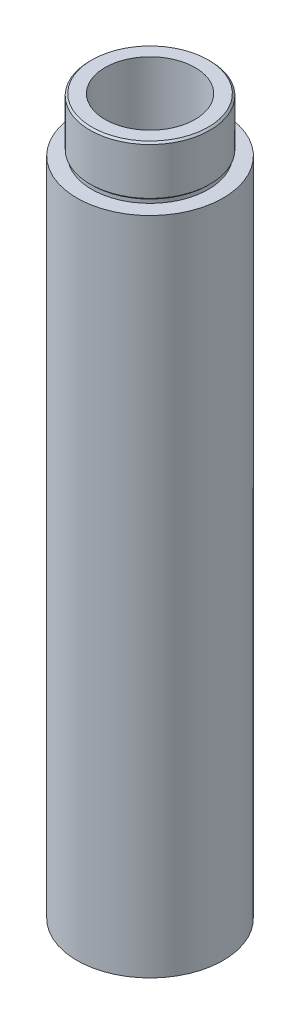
ISO-10303-21;
HEADER;
FILE_DESCRIPTION(('STEP AP214'),'2;1');
FILE_NAME('part.step','',(''),(''),'','','');
FILE_SCHEMA(('AUTOMOTIVE_DESIGN { 1 0 10303 214 1 1 1 1 }'));
ENDSEC;
DATA;
#1=APPLICATION_CONTEXT('core data for automotive mechanical design processes');
#2=APPLICATION_PROTOCOL_DEFINITION('international standard','automotive_design',2000,#1);
#3=PRODUCT_CONTEXT('',#1,'mechanical');
#4=PRODUCT('Part','Part','',(#3));
#5=PRODUCT_RELATED_PRODUCT_CATEGORY('part','',(#4));
#6=PRODUCT_DEFINITION_FORMATION('','',#4);
#7=PRODUCT_DEFINITION_CONTEXT('part definition',#1,'design');
#8=PRODUCT_DEFINITION('design','',#6,#7);
#9=PRODUCT_DEFINITION_SHAPE('','',#8);
#10=(LENGTH_UNIT() NAMED_UNIT(*) SI_UNIT(.MILLI.,.METRE.));
#11=(NAMED_UNIT(*) PLANE_ANGLE_UNIT() SI_UNIT($,.RADIAN.));
#12=(NAMED_UNIT(*) SI_UNIT($,.STERADIAN.) SOLID_ANGLE_UNIT());
#13=UNCERTAINTY_MEASURE_WITH_UNIT(LENGTH_MEASURE(1.E-05),#10,'distance_accuracy_value','');
#14=(GEOMETRIC_REPRESENTATION_CONTEXT(3) GLOBAL_UNCERTAINTY_ASSIGNED_CONTEXT((#13)) GLOBAL_UNIT_ASSIGNED_CONTEXT((#10,
#11,#12)) REPRESENTATION_CONTEXT('',''));
#15=CARTESIAN_POINT('',(0.,0.,0.));
#16=DIRECTION('',(0.,0.,1.));
#17=DIRECTION('',(1.,0.,0.));
#18=AXIS2_PLACEMENT_3D('',#15,#16,#17);
#19=CARTESIAN_POINT('',(0.,0.,0.));
#20=DIRECTION('',(0.,-1.,0.));
#21=DIRECTION('',(0.,0.,-1.));
#22=AXIS2_PLACEMENT_3D('',#19,#20,#21);
#23=CYLINDRICAL_SURFACE('',#22,15.4686);
#24=CARTESIAN_POINT('',(0.,139.7,0.));
#25=DIRECTION('',(0.,-1.,0.));
#26=DIRECTION('',(0.,0.,-1.));
#27=AXIS2_PLACEMENT_3D('',#24,#25,#26);
#28=CIRCLE('',#27,15.4686);
#29=CARTESIAN_POINT('',(0.,139.7,-15.4686));
#30=VERTEX_POINT('',#29);
#31=EDGE_CURVE('E12',#30,#30,#28,.T.);
#32=ORIENTED_EDGE('',*,*,#31,.T.);
#33=EDGE_LOOP('',(#32));
#34=FACE_BOUND('',#33,.T.);
#35=CARTESIAN_POINT('',(0.,0.,0.));
#36=DIRECTION('',(0.,-1.,0.));
#37=DIRECTION('',(0.,0.,-1.));
#38=AXIS2_PLACEMENT_3D('',#35,#36,#37);
#39=CIRCLE('',#38,15.4686);
#40=CARTESIAN_POINT('',(0.,0.,-15.4686));
#41=VERTEX_POINT('',#40);
#42=EDGE_CURVE('E90',#41,#41,#39,.T.);
#43=ORIENTED_EDGE('',*,*,#42,.F.);
#44=EDGE_LOOP('',(#43));
#45=FACE_BOUND('',#44,.T.);
#46=ADVANCED_FACE('F44',(#34,#45),#23,.T.);
#47=CARTESIAN_POINT('',(15.4686,139.7,0.));
#48=DIRECTION('',(0.,1.,0.));
#49=DIRECTION('',(0.,0.,1.));
#50=AXIS2_PLACEMENT_3D('',#47,#48,#49);
#51=PLANE('',#50);
#52=CARTESIAN_POINT('',(0.,139.7,0.));
#53=DIRECTION('',(0.,-1.,0.));
#54=DIRECTION('',(0.,0.,-1.));
#55=AXIS2_PLACEMENT_3D('',#52,#53,#54);
#56=CIRCLE('',#55,12.319);
#57=CARTESIAN_POINT('',(0.,139.7,-12.319));
#58=VERTEX_POINT('',#57);
#59=EDGE_CURVE('E50',#58,#58,#56,.T.);
#60=ORIENTED_EDGE('',*,*,#59,.T.);
#61=EDGE_LOOP('',(#60));
#62=FACE_BOUND('',#61,.T.);
#63=ORIENTED_EDGE('',*,*,#31,.F.);
#64=EDGE_LOOP('',(#63));
#65=FACE_BOUND('',#64,.T.);
#66=ADVANCED_FACE('F98',(#62,#65),#51,.T.);
#67=CARTESIAN_POINT('',(0.,0.,0.));
#68=DIRECTION('',(0.,-1.,0.));
#69=DIRECTION('',(0.,0.,-1.));
#70=AXIS2_PLACEMENT_3D('',#67,#68,#69);
#71=CYLINDRICAL_SURFACE('',#70,12.319);
#72=CARTESIAN_POINT('',(0.,140.49375,0.));
#73=DIRECTION('',(0.,-1.,0.));
#74=DIRECTION('',(0.,0.,-1.));
#75=AXIS2_PLACEMENT_3D('',#72,#73,#74);
#76=CIRCLE('',#75,12.319);
#77=CARTESIAN_POINT('',(0.,140.49375,-12.319));
#78=VERTEX_POINT('',#77);
#79=EDGE_CURVE('E54',#78,#78,#76,.T.);
#80=ORIENTED_EDGE('',*,*,#79,.T.);
#81=EDGE_LOOP('',(#80));
#82=FACE_BOUND('',#81,.T.);
#83=ORIENTED_EDGE('',*,*,#59,.F.);
#84=EDGE_LOOP('',(#83));
#85=FACE_BOUND('',#84,.T.);
#86=ADVANCED_FACE('F102',(#82,#85),#71,.T.);
#87=CARTESIAN_POINT('',(0.,140.49375,0.));
#88=DIRECTION('',(0.,1.,0.));
#89=DIRECTION('',(0.,0.,1.));
#90=AXIS2_PLACEMENT_3D('',#87,#88,#89);
#91=CONICAL_SURFACE('',#90,12.319,0.785398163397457);
#92=CARTESIAN_POINT('',(0.,140.87475,0.));
#93=DIRECTION('',(0.,-1.,0.));
#94=DIRECTION('',(0.,0.,-1.));
#95=AXIS2_PLACEMENT_3D('',#92,#93,#94);
#96=CIRCLE('',#95,12.7);
#97=CARTESIAN_POINT('',(0.,140.87475,-12.7));
#98=VERTEX_POINT('',#97);
#99=EDGE_CURVE('E58',#98,#98,#96,.T.);
#100=ORIENTED_EDGE('',*,*,#99,.T.);
#101=EDGE_LOOP('',(#100));
#102=FACE_BOUND('',#101,.T.);
#103=ORIENTED_EDGE('',*,*,#79,.F.);
#104=EDGE_LOOP('',(#103));
#105=FACE_BOUND('',#104,.T.);
#106=ADVANCED_FACE('F106',(#102,#105),#91,.T.);
#107=CARTESIAN_POINT('',(0.,0.,0.));
#108=DIRECTION('',(0.,-1.,0.));
#109=DIRECTION('',(0.,0.,-1.));
#110=AXIS2_PLACEMENT_3D('',#107,#108,#109);
#111=CYLINDRICAL_SURFACE('',#110,12.7);
#112=CARTESIAN_POINT('',(0.,150.749,0.));
#113=DIRECTION('',(0.,-1.,0.));
#114=DIRECTION('',(0.,0.,-1.));
#115=AXIS2_PLACEMENT_3D('',#112,#113,#114);
#116=CIRCLE('',#115,12.7);
#117=CARTESIAN_POINT('',(0.,150.749,-12.7));
#118=VERTEX_POINT('',#117);
#119=EDGE_CURVE('E63',#118,#118,#116,.T.);
#120=ORIENTED_EDGE('',*,*,#119,.T.);
#121=EDGE_LOOP('',(#120));
#122=FACE_BOUND('',#121,.T.);
#123=ORIENTED_EDGE('',*,*,#99,.F.);
#124=EDGE_LOOP('',(#123));
#125=FACE_BOUND('',#124,.T.);
#126=ADVANCED_FACE('F113',(#122,#125),#111,.T.);
#127=CARTESIAN_POINT('',(0.,150.749,0.));
#128=DIRECTION('',(0.,-1.,0.));
#129=DIRECTION('',(0.,0.,-1.));
#130=AXIS2_PLACEMENT_3D('',#127,#128,#129);
#131=CONICAL_SURFACE('',#130,12.7,0.785398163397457);
#132=CARTESIAN_POINT('',(0.,151.13,0.));
#133=DIRECTION('',(0.,-1.,0.));
#134=DIRECTION('',(0.,0.,-1.));
#135=AXIS2_PLACEMENT_3D('',#132,#133,#134);
#136=CIRCLE('',#135,12.319);
#137=CARTESIAN_POINT('',(0.,151.13,-12.319));
#138=VERTEX_POINT('',#137);
#139=EDGE_CURVE('E66',#138,#138,#136,.T.);
#140=ORIENTED_EDGE('',*,*,#139,.T.);
#141=EDGE_LOOP('',(#140));
#142=FACE_BOUND('',#141,.T.);
#143=ORIENTED_EDGE('',*,*,#119,.F.);
#144=EDGE_LOOP('',(#143));
#145=FACE_BOUND('',#144,.T.);
#146=ADVANCED_FACE('F117',(#142,#145),#131,.T.);
#147=CARTESIAN_POINT('',(12.319,151.13,0.));
#148=DIRECTION('',(0.,1.,0.));
#149=DIRECTION('',(0.,0.,1.));
#150=AXIS2_PLACEMENT_3D('',#147,#148,#149);
#151=PLANE('',#150);
#152=CARTESIAN_POINT('',(0.,151.13,0.));
#153=DIRECTION('',(0.,-1.,0.));
#154=DIRECTION('',(0.,0.,-1.));
#155=AXIS2_PLACEMENT_3D('',#152,#153,#154);
#156=CIRCLE('',#155,9.525);
#157=CARTESIAN_POINT('',(0.,151.13,-9.525));
#158=VERTEX_POINT('',#157);
#159=EDGE_CURVE('E69',#158,#158,#156,.T.);
#160=ORIENTED_EDGE('',*,*,#159,.T.);
#161=EDGE_LOOP('',(#160));
#162=FACE_BOUND('',#161,.T.);
#163=ORIENTED_EDGE('',*,*,#139,.F.);
#164=EDGE_LOOP('',(#163));
#165=FACE_BOUND('',#164,.T.);
#166=ADVANCED_FACE('F121',(#162,#165),#151,.T.);
#167=CARTESIAN_POINT('',(0.,0.,0.));
#168=DIRECTION('',(0.,-1.,0.));
#169=DIRECTION('',(0.,0.,-1.));
#170=AXIS2_PLACEMENT_3D('',#167,#168,#169);
#171=CYLINDRICAL_SURFACE('',#170,9.52500000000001);
#172=CARTESIAN_POINT('',(0.,12.7,0.));
#173=DIRECTION('',(0.,-1.,0.));
#174=DIRECTION('',(0.,0.,-1.));
#175=AXIS2_PLACEMENT_3D('',#172,#173,#174);
#176=CIRCLE('',#175,9.52500000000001);
#177=CARTESIAN_POINT('',(0.,12.7,-9.52500000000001));
#178=VERTEX_POINT('',#177);
#179=EDGE_CURVE('E72',#178,#178,#176,.T.);
#180=ORIENTED_EDGE('',*,*,#179,.T.);
#181=EDGE_LOOP('',(#180));
#182=FACE_BOUND('',#181,.T.);
#183=ORIENTED_EDGE('',*,*,#159,.F.);
#184=EDGE_LOOP('',(#183));
#185=FACE_BOUND('',#184,.T.);
#186=ADVANCED_FACE('F125',(#182,#185),#171,.F.);
#187=CARTESIAN_POINT('',(9.52500000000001,12.7,0.));
#188=DIRECTION('',(0.,-1.,0.));
#189=DIRECTION('',(0.,0.,-1.));
#190=AXIS2_PLACEMENT_3D('',#187,#188,#189);
#191=PLANE('',#190);
#192=CARTESIAN_POINT('',(0.,12.7,0.));
#193=DIRECTION('',(0.,-1.,0.));
#194=DIRECTION('',(0.,0.,-1.));
#195=AXIS2_PLACEMENT_3D('',#192,#193,#194);
#196=CIRCLE('',#195,12.7);
#197=CARTESIAN_POINT('',(0.,12.7,-12.7));
#198=VERTEX_POINT('',#197);
#199=EDGE_CURVE('E75',#198,#198,#196,.T.);
#200=ORIENTED_EDGE('',*,*,#199,.T.);
#201=EDGE_LOOP('',(#200));
#202=FACE_BOUND('',#201,.T.);
#203=ORIENTED_EDGE('',*,*,#179,.F.);
#204=EDGE_LOOP('',(#203));
#205=FACE_BOUND('',#204,.T.);
#206=ADVANCED_FACE('F129',(#202,#205),#191,.T.);
#207=CARTESIAN_POINT('',(0.,0.,0.));
#208=DIRECTION('',(0.,-1.,0.));
#209=DIRECTION('',(0.,0.,-1.));
#210=AXIS2_PLACEMENT_3D('',#207,#208,#209);
#211=CYLINDRICAL_SURFACE('',#210,12.7);
#212=CARTESIAN_POINT('',(0.,11.90625,0.));
#213=DIRECTION('',(0.,-1.,0.));
#214=DIRECTION('',(0.,0.,-1.));
#215=AXIS2_PLACEMENT_3D('',#212,#213,#214);
#216=CIRCLE('',#215,12.7);
#217=CARTESIAN_POINT('',(0.,11.90625,-12.7));
#218=VERTEX_POINT('',#217);
#219=EDGE_CURVE('E78',#218,#218,#216,.T.);
#220=ORIENTED_EDGE('',*,*,#219,.T.);
#221=EDGE_LOOP('',(#220));
#222=FACE_BOUND('',#221,.T.);
#223=ORIENTED_EDGE('',*,*,#199,.F.);
#224=EDGE_LOOP('',(#223));
#225=FACE_BOUND('',#224,.T.);
#226=ADVANCED_FACE('F133',(#222,#225),#211,.F.);
#227=CARTESIAN_POINT('',(0.,11.90625,0.));
#228=DIRECTION('',(0.,1.,0.));
#229=DIRECTION('',(0.,0.,1.));
#230=AXIS2_PLACEMENT_3D('',#227,#228,#229);
#231=CONICAL_SURFACE('',#230,12.7,0.785398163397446);
#232=CARTESIAN_POINT('',(0.,11.52525,0.));
#233=DIRECTION('',(0.,-1.,0.));
#234=DIRECTION('',(0.,0.,-1.));
#235=AXIS2_PLACEMENT_3D('',#232,#233,#234);
#236=CIRCLE('',#235,12.319);
#237=CARTESIAN_POINT('',(0.,11.52525,-12.319));
#238=VERTEX_POINT('',#237);
#239=EDGE_CURVE('E81',#238,#238,#236,.T.);
#240=ORIENTED_EDGE('',*,*,#239,.T.);
#241=EDGE_LOOP('',(#240));
#242=FACE_BOUND('',#241,.T.);
#243=ORIENTED_EDGE('',*,*,#219,.F.);
#244=EDGE_LOOP('',(#243));
#245=FACE_BOUND('',#244,.T.);
#246=ADVANCED_FACE('F137',(#242,#245),#231,.F.);
#247=CARTESIAN_POINT('',(0.,0.,0.));
#248=DIRECTION('',(0.,-1.,0.));
#249=DIRECTION('',(0.,0.,-1.));
#250=AXIS2_PLACEMENT_3D('',#247,#248,#249);
#251=CYLINDRICAL_SURFACE('',#250,12.319);
#252=CARTESIAN_POINT('',(0.,0.381000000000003,0.));
#253=DIRECTION('',(0.,-1.,0.));
#254=DIRECTION('',(0.,0.,-1.));
#255=AXIS2_PLACEMENT_3D('',#252,#253,#254);
#256=CIRCLE('',#255,12.319);
#257=CARTESIAN_POINT('',(0.,0.381000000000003,-12.319));
#258=VERTEX_POINT('',#257);
#259=EDGE_CURVE('E84',#258,#258,#256,.T.);
#260=ORIENTED_EDGE('',*,*,#259,.T.);
#261=EDGE_LOOP('',(#260));
#262=FACE_BOUND('',#261,.T.);
#263=ORIENTED_EDGE('',*,*,#239,.F.);
#264=EDGE_LOOP('',(#263));
#265=FACE_BOUND('',#264,.T.);
#266=ADVANCED_FACE('F141',(#262,#265),#251,.F.);
#267=CARTESIAN_POINT('',(0.,0.381000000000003,0.));
#268=DIRECTION('',(0.,-1.,0.));
#269=DIRECTION('',(0.,0.,-1.));
#270=AXIS2_PLACEMENT_3D('',#267,#268,#269);
#271=CONICAL_SURFACE('',#270,12.319,0.785398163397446);
#272=CARTESIAN_POINT('',(0.,0.,0.));
#273=DIRECTION('',(0.,-1.,0.));
#274=DIRECTION('',(0.,0.,-1.));
#275=AXIS2_PLACEMENT_3D('',#272,#273,#274);
#276=CIRCLE('',#275,12.7);
#277=CARTESIAN_POINT('',(0.,0.,-12.7));
#278=VERTEX_POINT('',#277);
#279=EDGE_CURVE('E87',#278,#278,#276,.T.);
#280=ORIENTED_EDGE('',*,*,#279,.T.);
#281=EDGE_LOOP('',(#280));
#282=FACE_BOUND('',#281,.T.);
#283=ORIENTED_EDGE('',*,*,#259,.F.);
#284=EDGE_LOOP('',(#283));
#285=FACE_BOUND('',#284,.T.);
#286=ADVANCED_FACE('F145',(#282,#285),#271,.F.);
#287=CARTESIAN_POINT('',(12.7,0.,0.));
#288=DIRECTION('',(0.,-1.,0.));
#289=DIRECTION('',(0.,0.,-1.));
#290=AXIS2_PLACEMENT_3D('',#287,#288,#289);
#291=PLANE('',#290);
#292=ORIENTED_EDGE('',*,*,#42,.T.);
#293=EDGE_LOOP('',(#292));
#294=FACE_BOUND('',#293,.T.);
#295=ORIENTED_EDGE('',*,*,#279,.F.);
#296=EDGE_LOOP('',(#295));
#297=FACE_BOUND('',#296,.T.);
#298=ADVANCED_FACE('F94',(#294,#297),#291,.T.);
#299=CLOSED_SHELL('',(#46,#66,#86,#106,#126,#146,#166,#186,#206,#226,#246,#266,#286,#298));
#300=MANIFOLD_SOLID_BREP('B2',#299);
#301=ADVANCED_BREP_SHAPE_REPRESENTATION('',(#18,#300),#14);
#302=SHAPE_DEFINITION_REPRESENTATION(#9,#301);
ENDSEC;
END-ISO-10303-21;
